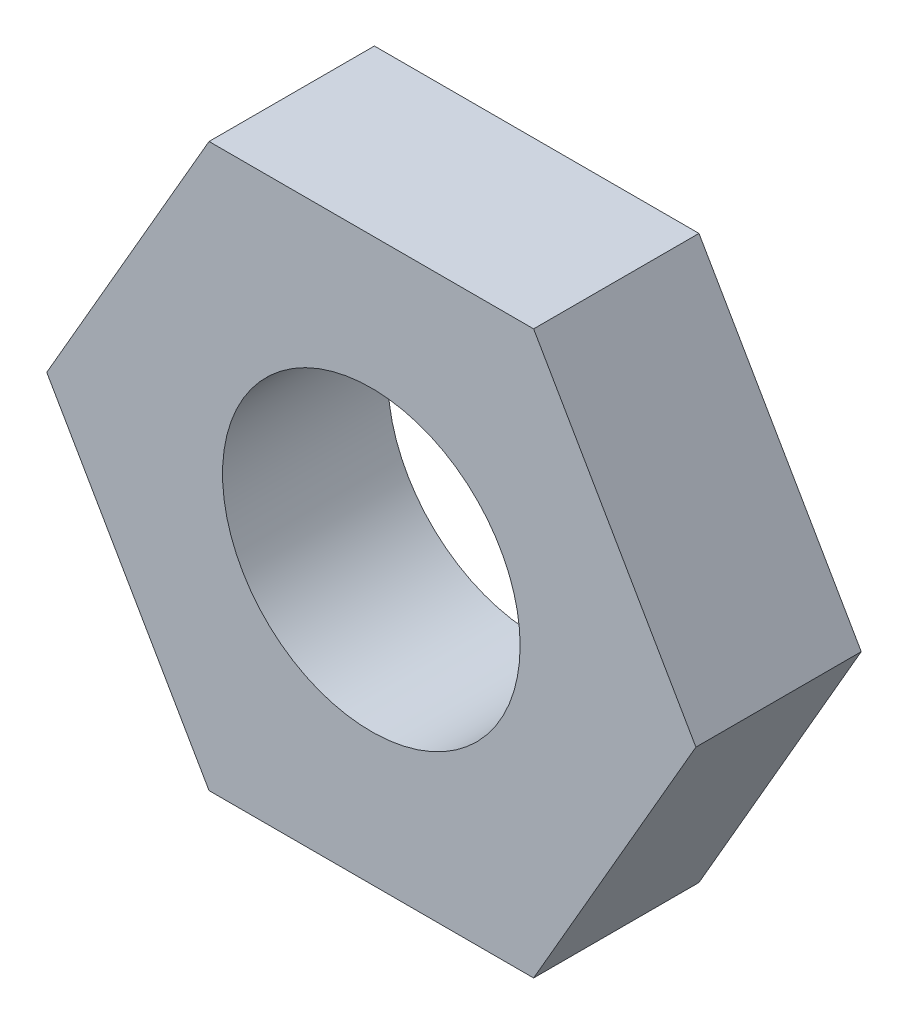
from build123d import *

# Parameters (mm, degrees)
EXTRUSION1_DEPTH       = 5
TROU_TARAUD_M10X1_01_D = 9


with BuildPart() as part:
    # Esquisse1 → Extrusion1 (new body)
    with BuildSketch(Plane.XY):
        Polygon((4.907477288, 8.5), (-4.907477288, 8.5), (-9.814954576, 0), (-4.907477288, -8.5), (4.907477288, -8.5), (9.814954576, 0), align=None)
    extrude(amount=EXTRUSION1_DEPTH)

    # Trou taraud_ M10x1.01 (through all)
    with Locations(Plane.XY.offset(5)):
        with Locations((0, 0)):
            Hole(TROU_TARAUD_M10X1_01_D / 2)


solid = part.part
